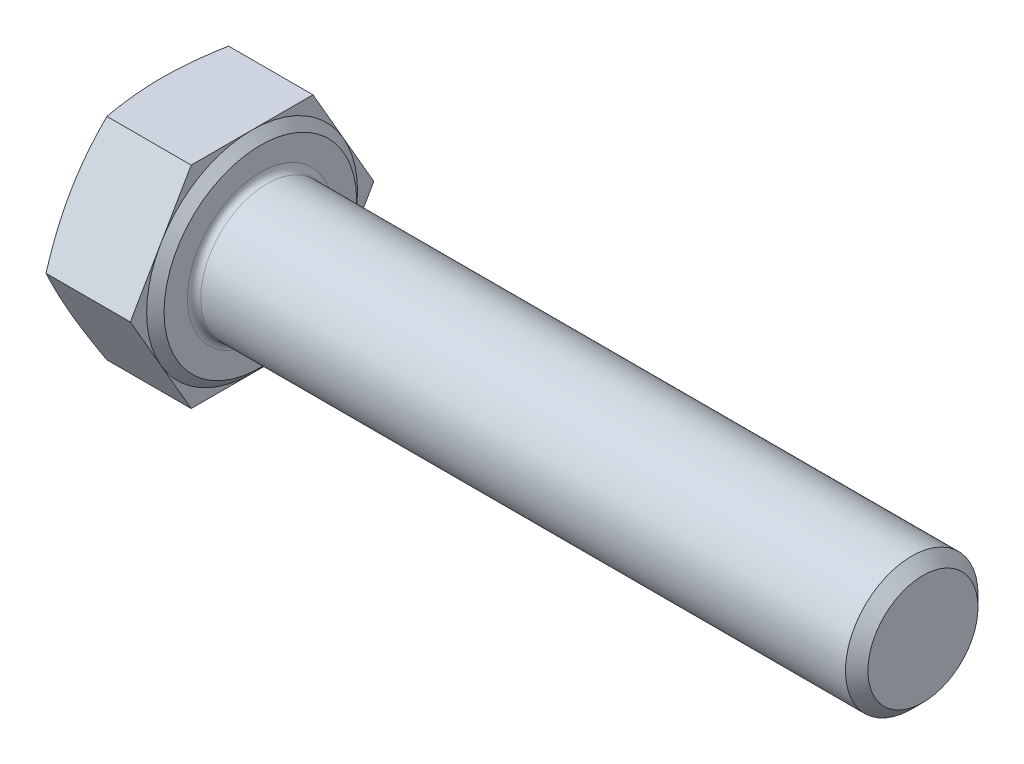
from build123d import *

# Parameters (mm, degrees)
BASEHEAD_DEPTH = 5.45
SKETCH3_R      = 4
BASEBODY_DEPTH = 40
HEADFILLET_R   = 0.4
CHAMFER1_SIZE  = 0.6765


with BuildPart() as part:
    # Sketch-BaseHead → BaseHead (new body)
    with BuildSketch(Plane(origin=(0, 0, 0), x_dir=(0, 0, -1), z_dir=(1, 0, 0))):
        Polygon((7.349668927, 0), (3.674834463, 6.365), (-3.674834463, 6.365), (-7.349668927, 0), (-3.674834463, -6.365), (3.674834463, -6.365), align=None)
    extrude(amount=BASEHEAD_DEPTH)

    # Sketch4 → HeadChamfer (revolve, cut)
    with BuildSketch(Plane(origin=(-0.264637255, 0, 5.916896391), x_dir=(0, 0, -1), z_dir=(0, 1, 0))):
        Polygon((13.266565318, -0.264637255), (12.281896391, -0.264637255), (13.266565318, -0.623027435), align=None)
    revolve(axis=Axis((-4.001564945, 0, 0), (1, 0, 0)), mode=Mode.SUBTRACT)

    # Sketch1 → Revolve1 (revolve)
    with BuildSketch(Plane.XY, mode=Mode.PRIVATE) as revolve1_sk:
        Polygon((5.45, 0), (5.95, 0), (5.95, -5.815), (5.45, -6.365), align=None)
    revolve(revolve1_sk.sketch.rotate(Axis((-4.001564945, 0, 0), (1, 0, 0)), 270), axis=Axis((-4.001564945, 0, 0), (1, 0, 0)))

    # Sketch3 → BaseBody (add)
    with BuildSketch(Plane(origin=(5.95, 0, 0), x_dir=(0, 0, -1), z_dir=(1, 0, 0))):
        Circle(SKETCH3_R)
    extrude(amount=BASEBODY_DEPTH)

    # HeadFillet
    headfillet_edges = [part.edges().sort_by_distance(p)[0] for p in [
        (5.95, 0, 4),
    ]]
    fillet(headfillet_edges, radius=HEADFILLET_R)

    # Chamfer1
    chamfer1_edges = [part.edges().sort_by_distance(p)[0] for p in [
        (45.95, 0, 4),
    ]]
    chamfer(chamfer1_edges, length=CHAMFER1_SIZE)


solid = part.part
